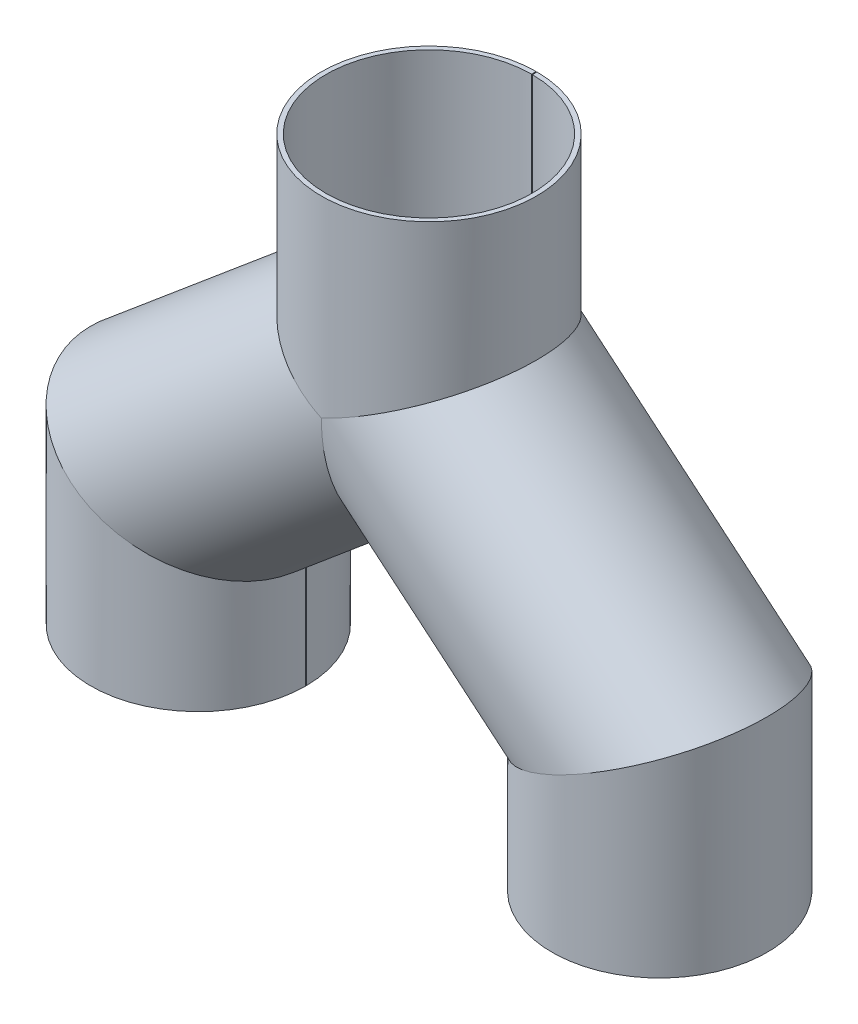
ISO-10303-21;
HEADER;
FILE_DESCRIPTION(('STEP AP214'),'2;1');
FILE_NAME('part.step','',(''),(''),'','','');
FILE_SCHEMA(('AUTOMOTIVE_DESIGN { 1 0 10303 214 1 1 1 1 }'));
ENDSEC;
DATA;
#1=APPLICATION_CONTEXT('core data for automotive mechanical design processes');
#2=APPLICATION_PROTOCOL_DEFINITION('international standard','automotive_design',2000,#1);
#3=PRODUCT_CONTEXT('',#1,'mechanical');
#4=PRODUCT('Part','Part','',(#3));
#5=PRODUCT_RELATED_PRODUCT_CATEGORY('part','',(#4));
#6=PRODUCT_DEFINITION_FORMATION('','',#4);
#7=PRODUCT_DEFINITION_CONTEXT('part definition',#1,'design');
#8=PRODUCT_DEFINITION('design','',#6,#7);
#9=PRODUCT_DEFINITION_SHAPE('','',#8);
#10=(LENGTH_UNIT() NAMED_UNIT(*) SI_UNIT(.MILLI.,.METRE.));
#11=(NAMED_UNIT(*) PLANE_ANGLE_UNIT() SI_UNIT($,.RADIAN.));
#12=(NAMED_UNIT(*) SI_UNIT($,.STERADIAN.) SOLID_ANGLE_UNIT());
#13=UNCERTAINTY_MEASURE_WITH_UNIT(LENGTH_MEASURE(1.E-05),#10,'distance_accuracy_value','');
#14=(GEOMETRIC_REPRESENTATION_CONTEXT(3) GLOBAL_UNCERTAINTY_ASSIGNED_CONTEXT((#13)) GLOBAL_UNIT_ASSIGNED_CONTEXT((#10,
#11,#12)) REPRESENTATION_CONTEXT('',''));
#15=CARTESIAN_POINT('',(0.,0.,0.));
#16=DIRECTION('',(0.,0.,1.));
#17=DIRECTION('',(1.,0.,0.));
#18=AXIS2_PLACEMENT_3D('',#15,#16,#17);
#19=CARTESIAN_POINT('',(-300.,-186.446817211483,0.));
#20=DIRECTION('',(0.,-1.,0.));
#21=DIRECTION('',(0.,0.,-1.));
#22=AXIS2_PLACEMENT_3D('',#19,#20,#21);
#23=CYLINDRICAL_SURFACE('',#22,140.);
#24=DIRECTION('',(0.,-1.,0.));
#25=VECTOR('',#24,1.);
#26=CARTESIAN_POINT('',(-160.00089285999,-186.446817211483,-0.5));
#27=LINE('',#26,#25);
#28=CARTESIAN_POINT('',(-160.00089285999,-317.012545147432,-0.499999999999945));
#29=VERTEX_POINT('',#28);
#30=CARTESIAN_POINT('',(-160.00089285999,-451.729889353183,-0.5));
#31=VERTEX_POINT('',#30);
#32=EDGE_CURVE('E125',#29,#31,#27,.T.);
#33=ORIENTED_EDGE('',*,*,#32,.T.);
#34=CARTESIAN_POINT('',(-300.,-451.729889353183,0.));
#35=DIRECTION('',(0.,-1.,0.));
#36=DIRECTION('',(0.,0.,1.));
#37=AXIS2_PLACEMENT_3D('',#34,#35,#36);
#38=CIRCLE('',#37,140.);
#39=CARTESIAN_POINT('',(-160.00089285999,-451.729889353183,0.5));
#40=VERTEX_POINT('',#39);
#41=EDGE_CURVE('E113',#40,#31,#38,.T.);
#42=ORIENTED_EDGE('',*,*,#41,.F.);
#43=DIRECTION('',(0.,-1.,0.));
#44=VECTOR('',#43,1.);
#45=CARTESIAN_POINT('',(-160.00089285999,-186.446817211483,0.5));
#46=LINE('',#45,#44);
#47=CARTESIAN_POINT('',(-160.00089285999,-317.012545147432,0.499999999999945));
#48=VERTEX_POINT('',#47);
#49=EDGE_CURVE('E103',#48,#40,#46,.T.);
#50=ORIENTED_EDGE('',*,*,#49,.F.);
#51=CARTESIAN_POINT('',(-300.,-251.729889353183,0.));
#52=DIRECTION('',(-0.4226182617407,-0.906307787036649,0.));
#53=DIRECTION('',(0.90630778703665,-0.422618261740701,0.));
#54=AXIS2_PLACEMENT_3D('',#51,#52,#53);
#55=ELLIPSE('',#54,154.472908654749,140.);
#56=EDGE_CURVE('E114',#48,#29,#55,.T.);
#57=ORIENTED_EDGE('',*,*,#56,.T.);
#58=EDGE_LOOP('',(#33,#42,#50,#57));
#59=FACE_BOUND('',#58,.T.);
#60=ADVANCED_FACE('F60',(#59),#23,.T.);
#61=CARTESIAN_POINT('',(-300.,-186.446817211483,0.));
#62=DIRECTION('',(0.,-1.,0.));
#63=DIRECTION('',(0.,0.,-1.));
#64=AXIS2_PLACEMENT_3D('',#61,#62,#63);
#65=CYLINDRICAL_SURFACE('',#64,134.);
#66=CARTESIAN_POINT('',(-300.,-251.729889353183,0.));
#67=DIRECTION('',(-0.4226182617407,-0.906307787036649,0.));
#68=DIRECTION('',(0.90630778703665,-0.422618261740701,0.));
#69=AXIS2_PLACEMENT_3D('',#66,#67,#68);
#70=ELLIPSE('',#69,147.852641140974,134.);
#71=CARTESIAN_POINT('',(-166.000932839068,-314.214680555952,0.499999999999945));
#72=VERTEX_POINT('',#71);
#73=CARTESIAN_POINT('',(-166.000932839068,-314.214680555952,-0.499999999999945));
#74=VERTEX_POINT('',#73);
#75=EDGE_CURVE('E118',#72,#74,#70,.T.);
#76=ORIENTED_EDGE('',*,*,#75,.F.);
#77=DIRECTION('',(0.,-1.,0.));
#78=VECTOR('',#77,1.);
#79=CARTESIAN_POINT('',(-166.000932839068,-186.446817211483,0.5));
#80=LINE('',#79,#78);
#81=CARTESIAN_POINT('',(-166.000932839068,-451.729889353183,0.5));
#82=VERTEX_POINT('',#81);
#83=EDGE_CURVE('E100',#72,#82,#80,.T.);
#84=ORIENTED_EDGE('',*,*,#83,.T.);
#85=CARTESIAN_POINT('',(-300.,-451.729889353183,0.));
#86=DIRECTION('',(0.,-1.,0.));
#87=DIRECTION('',(1.,0.,0.));
#88=AXIS2_PLACEMENT_3D('',#85,#86,#87);
#89=CIRCLE('',#88,134.);
#90=CARTESIAN_POINT('',(-166.000932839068,-451.729889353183,-0.5));
#91=VERTEX_POINT('',#90);
#92=EDGE_CURVE('E110',#82,#91,#89,.T.);
#93=ORIENTED_EDGE('',*,*,#92,.T.);
#94=DIRECTION('',(0.,-1.,0.));
#95=VECTOR('',#94,1.);
#96=CARTESIAN_POINT('',(-166.000932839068,-186.446817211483,-0.5));
#97=LINE('',#96,#95);
#98=EDGE_CURVE('E120',#74,#91,#97,.T.);
#99=ORIENTED_EDGE('',*,*,#98,.F.);
#100=EDGE_LOOP('',(#76,#84,#93,#99));
#101=FACE_BOUND('',#100,.T.);
#102=ADVANCED_FACE('F116',(#101),#65,.F.);
#103=CARTESIAN_POINT('',(-300.,-451.729889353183,0.));
#104=DIRECTION('',(0.,1.,0.));
#105=DIRECTION('',(0.,0.,1.));
#106=AXIS2_PLACEMENT_3D('',#103,#104,#105);
#107=PLANE('',#106);
#108=DIRECTION('',(1.,0.,0.));
#109=VECTOR('',#108,1.);
#110=CARTESIAN_POINT('',(-300.,-451.729889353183,-0.5));
#111=LINE('',#110,#109);
#112=EDGE_CURVE('E107',#91,#31,#111,.T.);
#113=ORIENTED_EDGE('',*,*,#112,.F.);
#114=ORIENTED_EDGE('',*,*,#92,.F.);
#115=DIRECTION('',(1.,0.,0.));
#116=VECTOR('',#115,1.);
#117=CARTESIAN_POINT('',(-300.,-451.729889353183,0.5));
#118=LINE('',#117,#116);
#119=EDGE_CURVE('E96',#82,#40,#118,.T.);
#120=ORIENTED_EDGE('',*,*,#119,.T.);
#121=ORIENTED_EDGE('',*,*,#41,.T.);
#122=EDGE_LOOP('',(#113,#114,#120,#121));
#123=FACE_BOUND('',#122,.T.);
#124=ADVANCED_FACE('F111',(#123),#107,.F.);
#125=CARTESIAN_POINT('',(-160.,-317.012961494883,1365.60438801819));
#126=DIRECTION('',(0.4226182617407,0.906307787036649,0.));
#127=DIRECTION('',(0.90630778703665,-0.422618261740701,0.));
#128=AXIS2_PLACEMENT_3D('',#125,#126,#127);
#129=PLANE('',#128);
#130=ORIENTED_EDGE('',*,*,#56,.F.);
#131=DIRECTION('',(-0.90630778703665,0.422618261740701,0.));
#132=VECTOR('',#131,1.);
#133=CARTESIAN_POINT('',(-160.,-317.012961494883,0.499999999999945));
#134=LINE('',#133,#132);
#135=EDGE_CURVE('E67',#48,#72,#134,.T.);
#136=ORIENTED_EDGE('',*,*,#135,.T.);
#137=ORIENTED_EDGE('',*,*,#75,.T.);
#138=DIRECTION('',(-0.90630778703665,0.422618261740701,0.));
#139=VECTOR('',#138,1.);
#140=CARTESIAN_POINT('',(-160.,-317.012961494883,-0.499999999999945));
#141=LINE('',#140,#139);
#142=EDGE_CURVE('E13',#29,#74,#141,.T.);
#143=ORIENTED_EDGE('',*,*,#142,.F.);
#144=EDGE_LOOP('',(#130,#136,#137,#143));
#145=FACE_BOUND('',#144,.T.);
#146=ADVANCED_FACE('F132',(#145),#129,.T.);
#147=CARTESIAN_POINT('',(-300.,250.,0.5));
#148=DIRECTION('',(0.,0.,1.));
#149=DIRECTION('',(-1.,0.,0.));
#150=AXIS2_PLACEMENT_3D('',#147,#148,#149);
#151=PLANE('',#150);
#152=ORIENTED_EDGE('',*,*,#135,.F.);
#153=ORIENTED_EDGE('',*,*,#49,.T.);
#154=ORIENTED_EDGE('',*,*,#119,.F.);
#155=ORIENTED_EDGE('',*,*,#83,.F.);
#156=EDGE_LOOP('',(#152,#153,#154,#155));
#157=FACE_BOUND('',#156,.T.);
#158=ADVANCED_FACE('F98',(#157),#151,.F.);
#159=CARTESIAN_POINT('',(-300.,250.,-0.5));
#160=DIRECTION('',(0.,0.,1.));
#161=DIRECTION('',(-1.,0.,0.));
#162=AXIS2_PLACEMENT_3D('',#159,#160,#161);
#163=PLANE('',#162);
#164=ORIENTED_EDGE('',*,*,#32,.F.);
#165=ORIENTED_EDGE('',*,*,#142,.T.);
#166=ORIENTED_EDGE('',*,*,#98,.T.);
#167=ORIENTED_EDGE('',*,*,#112,.T.);
#168=EDGE_LOOP('',(#164,#165,#166,#167));
#169=FACE_BOUND('',#168,.T.);
#170=ADVANCED_FACE('F134',(#169),#163,.T.);
#171=CLOSED_SHELL('',(#60,#102,#124,#146,#158,#170));
#172=MANIFOLD_SOLID_BREP('B2',#171);
#173=CARTESIAN_POINT('',(0.,0.,0.));
#174=DIRECTION('',(-0.766044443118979,-0.642787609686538,0.));
#175=DIRECTION('',(-0.642787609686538,0.766044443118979,0.));
#176=AXIS2_PLACEMENT_3D('',#173,#174,#175);
#177=CYLINDRICAL_SURFACE('',#176,140.);
#178=DIRECTION('',(-0.766044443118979,-0.642787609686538,0.));
#179=VECTOR('',#178,1.);
#180=CARTESIAN_POINT('',(89.9896914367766,-107.245538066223,0.5));
#181=LINE('',#180,#179);
#182=CARTESIAN_POINT('',(-160.00089285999,-317.012545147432,0.5));
#183=VERTEX_POINT('',#182);
#184=CARTESIAN_POINT('',(0.,-182.755854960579,0.499999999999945));
#185=VERTEX_POINT('',#184);
#186=EDGE_CURVE('E290',#183,#185,#181,.F.);
#187=ORIENTED_EDGE('',*,*,#186,.T.);
#188=CARTESIAN_POINT('',(0.,0.,0.));
#189=DIRECTION('',(-1.,0.,0.));
#190=DIRECTION('',(0.,-1.,0.));
#191=AXIS2_PLACEMENT_3D('',#188,#189,#190);
#192=ELLIPSE('',#191,182.757020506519,140.);
#193=CARTESIAN_POINT('',(0.,0.,140.));
#194=VERTEX_POINT('',#193);
#195=EDGE_CURVE('E268',#194,#185,#192,.F.);
#196=ORIENTED_EDGE('',*,*,#195,.F.);
#197=CARTESIAN_POINT('',(0.,0.,0.));
#198=DIRECTION('',(0.4226182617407,0.90630778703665,0.));
#199=DIRECTION('',(-0.90630778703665,0.4226182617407,0.));
#200=AXIS2_PLACEMENT_3D('',#197,#198,#199);
#201=ELLIPSE('',#200,154.472908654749,140.);
#202=CARTESIAN_POINT('',(0.,1.11022302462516E-13,-140.));
#203=VERTEX_POINT('',#202);
#204=EDGE_CURVE('E267',#194,#203,#201,.F.);
#205=ORIENTED_EDGE('',*,*,#204,.T.);
#206=CARTESIAN_POINT('',(0.,-182.755854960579,-0.499999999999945));
#207=VERTEX_POINT('',#206);
#208=EDGE_CURVE('E251',#207,#203,#192,.F.);
#209=ORIENTED_EDGE('',*,*,#208,.F.);
#210=DIRECTION('',(-0.766044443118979,-0.642787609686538,0.));
#211=VECTOR('',#210,1.);
#212=CARTESIAN_POINT('',(89.9896914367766,-107.245538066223,-0.5));
#213=LINE('',#212,#211);
#214=CARTESIAN_POINT('',(-160.00089285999,-317.012545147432,-0.5));
#215=VERTEX_POINT('',#214);
#216=EDGE_CURVE('E257',#215,#207,#213,.F.);
#217=ORIENTED_EDGE('',*,*,#216,.F.);
#218=CARTESIAN_POINT('',(-300.,-251.729889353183,0.));
#219=DIRECTION('',(-0.422618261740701,-0.906307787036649,0.));
#220=DIRECTION('',(-0.90630778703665,0.422618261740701,0.));
#221=AXIS2_PLACEMENT_3D('',#218,#219,#220);
#222=ELLIPSE('',#221,154.472908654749,140.);
#223=EDGE_CURVE('E280',#215,#183,#222,.F.);
#224=ORIENTED_EDGE('',*,*,#223,.T.);
#225=EDGE_LOOP('',(#187,#196,#205,#209,#217,#224));
#226=FACE_BOUND('',#225,.T.);
#227=ADVANCED_FACE('F194',(#226),#177,.T.);
#228=CARTESIAN_POINT('',(0.,-451.729889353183,1247.60175690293));
#229=DIRECTION('',(1.,0.,0.));
#230=DIRECTION('',(0.,-1.,0.));
#231=AXIS2_PLACEMENT_3D('',#228,#229,#230);
#232=PLANE('',#231);
#233=ORIENTED_EDGE('',*,*,#208,.T.);
#234=DIRECTION('',(0.,0.,-1.));
#235=VECTOR('',#234,1.);
#236=CARTESIAN_POINT('',(0.,0.,0.));
#237=LINE('',#236,#235);
#238=CARTESIAN_POINT('',(0.,0.,-134.));
#239=VERTEX_POINT('',#238);
#240=EDGE_CURVE('E271',#239,#203,#237,.T.);
#241=ORIENTED_EDGE('',*,*,#240,.F.);
#242=CARTESIAN_POINT('',(0.,0.,0.));
#243=DIRECTION('',(-1.,0.,0.));
#244=DIRECTION('',(0.,-1.,0.));
#245=AXIS2_PLACEMENT_3D('',#242,#243,#244);
#246=ELLIPSE('',#245,174.924576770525,134.);
#247=CARTESIAN_POINT('',(0.,-174.923359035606,-0.499999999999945));
#248=VERTEX_POINT('',#247);
#249=EDGE_CURVE('E253',#248,#239,#246,.F.);
#250=ORIENTED_EDGE('',*,*,#249,.F.);
#251=DIRECTION('',(0.,1.,0.));
#252=VECTOR('',#251,1.);
#253=CARTESIAN_POINT('',(0.,-451.729889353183,-0.499999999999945));
#254=LINE('',#253,#252);
#255=EDGE_CURVE('E201',#207,#248,#254,.T.);
#256=ORIENTED_EDGE('',*,*,#255,.F.);
#257=EDGE_LOOP('',(#233,#241,#250,#256));
#258=FACE_BOUND('',#257,.T.);
#259=ADVANCED_FACE('F248',(#258),#232,.T.);
#260=CARTESIAN_POINT('',(0.,0.,0.));
#261=DIRECTION('',(-0.766044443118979,-0.642787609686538,0.));
#262=DIRECTION('',(-0.642787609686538,0.766044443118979,0.));
#263=AXIS2_PLACEMENT_3D('',#260,#261,#262);
#264=CYLINDRICAL_SURFACE('',#263,134.);
#265=CARTESIAN_POINT('',(-300.,-251.729889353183,0.));
#266=DIRECTION('',(-0.422618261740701,-0.906307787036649,0.));
#267=DIRECTION('',(-0.90630778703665,0.422618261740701,0.));
#268=AXIS2_PLACEMENT_3D('',#265,#266,#267);
#269=ELLIPSE('',#268,147.852641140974,134.);
#270=CARTESIAN_POINT('',(-166.000932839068,-314.214680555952,-0.5));
#271=VERTEX_POINT('',#270);
#272=CARTESIAN_POINT('',(-166.000932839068,-314.214680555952,0.5));
#273=VERTEX_POINT('',#272);
#274=EDGE_CURVE('E279',#271,#273,#269,.F.);
#275=ORIENTED_EDGE('',*,*,#274,.F.);
#276=DIRECTION('',(-0.766044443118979,-0.642787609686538,0.));
#277=VECTOR('',#276,1.);
#278=CARTESIAN_POINT('',(86.1329400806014,-102.649240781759,-0.5));
#279=LINE('',#278,#277);
#280=EDGE_CURVE('E208',#271,#248,#279,.F.);
#281=ORIENTED_EDGE('',*,*,#280,.T.);
#282=ORIENTED_EDGE('',*,*,#249,.T.);
#283=CARTESIAN_POINT('',(0.,0.,0.));
#284=DIRECTION('',(0.4226182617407,0.90630778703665,0.));
#285=DIRECTION('',(-0.90630778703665,0.4226182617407,0.));
#286=AXIS2_PLACEMENT_3D('',#283,#284,#285);
#287=ELLIPSE('',#286,147.852641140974,134.);
#288=CARTESIAN_POINT('',(0.,0.,134.));
#289=VERTEX_POINT('',#288);
#290=EDGE_CURVE('E255',#289,#239,#287,.F.);
#291=ORIENTED_EDGE('',*,*,#290,.F.);
#292=CARTESIAN_POINT('',(0.,-174.923359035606,0.499999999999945));
#293=VERTEX_POINT('',#292);
#294=EDGE_CURVE('E269',#289,#293,#246,.F.);
#295=ORIENTED_EDGE('',*,*,#294,.T.);
#296=DIRECTION('',(-0.766044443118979,-0.642787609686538,0.));
#297=VECTOR('',#296,1.);
#298=CARTESIAN_POINT('',(86.1329400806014,-102.649240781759,0.5));
#299=LINE('',#298,#297);
#300=EDGE_CURVE('E292',#273,#293,#299,.F.);
#301=ORIENTED_EDGE('',*,*,#300,.F.);
#302=EDGE_LOOP('',(#275,#281,#282,#291,#295,#301));
#303=FACE_BOUND('',#302,.T.);
#304=ADVANCED_FACE('F288',(#303),#264,.F.);
#305=CARTESIAN_POINT('',(-160.,-317.012961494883,1319.63553279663));
#306=DIRECTION('',(0.422618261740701,0.906307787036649,0.));
#307=DIRECTION('',(0.906307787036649,-0.422618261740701,0.));
#308=AXIS2_PLACEMENT_3D('',#305,#306,#307);
#309=PLANE('',#308);
#310=ORIENTED_EDGE('',*,*,#223,.F.);
#311=DIRECTION('',(-0.906307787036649,0.422618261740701,0.));
#312=VECTOR('',#311,1.);
#313=CARTESIAN_POINT('',(-160.,-317.012961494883,-0.499999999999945));
#314=LINE('',#313,#312);
#315=EDGE_CURVE('E259',#215,#271,#314,.T.);
#316=ORIENTED_EDGE('',*,*,#315,.T.);
#317=ORIENTED_EDGE('',*,*,#274,.T.);
#318=DIRECTION('',(-0.906307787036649,0.422618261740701,0.));
#319=VECTOR('',#318,1.);
#320=CARTESIAN_POINT('',(-160.,-317.012961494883,0.499999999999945));
#321=LINE('',#320,#319);
#322=EDGE_CURVE('E289',#183,#273,#321,.T.);
#323=ORIENTED_EDGE('',*,*,#322,.F.);
#324=EDGE_LOOP('',(#310,#316,#317,#323));
#325=FACE_BOUND('',#324,.T.);
#326=ADVANCED_FACE('F298',(#325),#309,.F.);
#327=CARTESIAN_POINT('',(-536.126730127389,250.,1247.60175690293));
#328=DIRECTION('',(-0.4226182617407,-0.90630778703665,0.));
#329=DIRECTION('',(-0.90630778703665,0.4226182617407,0.));
#330=AXIS2_PLACEMENT_3D('',#327,#328,#329);
#331=PLANE('',#330);
#332=EDGE_CURVE('E277',#194,#289,#237,.T.);
#333=ORIENTED_EDGE('',*,*,#332,.T.);
#334=ORIENTED_EDGE('',*,*,#290,.T.);
#335=ORIENTED_EDGE('',*,*,#240,.T.);
#336=ORIENTED_EDGE('',*,*,#204,.F.);
#337=EDGE_LOOP('',(#333,#334,#335,#336));
#338=FACE_BOUND('',#337,.T.);
#339=ADVANCED_FACE('F286',(#338),#331,.F.);
#340=DIRECTION('',(0.,1.,0.));
#341=VECTOR('',#340,1.);
#342=CARTESIAN_POINT('',(0.,-451.729889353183,0.499999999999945));
#343=LINE('',#342,#341);
#344=EDGE_CURVE('E58',#185,#293,#343,.T.);
#345=ORIENTED_EDGE('',*,*,#344,.T.);
#346=ORIENTED_EDGE('',*,*,#294,.F.);
#347=ORIENTED_EDGE('',*,*,#332,.F.);
#348=ORIENTED_EDGE('',*,*,#195,.T.);
#349=EDGE_LOOP('',(#345,#346,#347,#348));
#350=FACE_BOUND('',#349,.T.);
#351=ADVANCED_FACE('F305',(#350),#232,.T.);
#352=CARTESIAN_POINT('',(205.256341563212,172.230520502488,-0.5));
#353=DIRECTION('',(0.,0.,1.));
#354=DIRECTION('',(-1.,0.,0.));
#355=AXIS2_PLACEMENT_3D('',#352,#353,#354);
#356=PLANE('',#355);
#357=ORIENTED_EDGE('',*,*,#315,.F.);
#358=ORIENTED_EDGE('',*,*,#216,.T.);
#359=ORIENTED_EDGE('',*,*,#255,.T.);
#360=ORIENTED_EDGE('',*,*,#280,.F.);
#361=EDGE_LOOP('',(#357,#358,#359,#360));
#362=FACE_BOUND('',#361,.T.);
#363=ADVANCED_FACE('F258',(#362),#356,.T.);
#364=CARTESIAN_POINT('',(205.256341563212,172.230520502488,0.5));
#365=DIRECTION('',(0.,0.,1.));
#366=DIRECTION('',(-1.,0.,0.));
#367=AXIS2_PLACEMENT_3D('',#364,#365,#366);
#368=PLANE('',#367);
#369=ORIENTED_EDGE('',*,*,#186,.F.);
#370=ORIENTED_EDGE('',*,*,#322,.T.);
#371=ORIENTED_EDGE('',*,*,#300,.T.);
#372=ORIENTED_EDGE('',*,*,#344,.F.);
#373=EDGE_LOOP('',(#369,#370,#371,#372));
#374=FACE_BOUND('',#373,.T.);
#375=ADVANCED_FACE('F299',(#374),#368,.F.);
#376=CLOSED_SHELL('',(#227,#259,#304,#326,#339,#351,#363,#375));
#377=MANIFOLD_SOLID_BREP('B7',#376);
#378=CARTESIAN_POINT('',(300.,-186.446817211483,0.));
#379=DIRECTION('',(0.,-1.,0.));
#380=DIRECTION('',(0.,0.,-1.));
#381=AXIS2_PLACEMENT_3D('',#378,#379,#380);
#382=CYLINDRICAL_SURFACE('',#381,140.);
#383=DIRECTION('',(0.,-1.,0.));
#384=VECTOR('',#383,1.);
#385=CARTESIAN_POINT('',(160.00089285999,-186.446817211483,-0.5));
#386=LINE('',#385,#384);
#387=CARTESIAN_POINT('',(160.00089285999,-317.012545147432,-0.499999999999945));
#388=VERTEX_POINT('',#387);
#389=CARTESIAN_POINT('',(160.00089285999,-451.729889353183,-0.5));
#390=VERTEX_POINT('',#389);
#391=EDGE_CURVE('E441',#388,#390,#386,.T.);
#392=ORIENTED_EDGE('',*,*,#391,.F.);
#393=CARTESIAN_POINT('',(300.,-251.729889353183,0.));
#394=DIRECTION('',(-0.4226182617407,0.906307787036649,0.));
#395=DIRECTION('',(-0.90630778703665,-0.422618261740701,0.));
#396=AXIS2_PLACEMENT_3D('',#393,#394,#395);
#397=ELLIPSE('',#396,154.472908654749,140.);
#398=CARTESIAN_POINT('',(160.00089285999,-317.012545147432,0.499999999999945));
#399=VERTEX_POINT('',#398);
#400=EDGE_CURVE('E433',#399,#388,#397,.T.);
#401=ORIENTED_EDGE('',*,*,#400,.F.);
#402=DIRECTION('',(0.,-1.,0.));
#403=VECTOR('',#402,1.);
#404=CARTESIAN_POINT('',(160.00089285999,-186.446817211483,0.5));
#405=LINE('',#404,#403);
#406=CARTESIAN_POINT('',(160.00089285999,-451.729889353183,0.5));
#407=VERTEX_POINT('',#406);
#408=EDGE_CURVE('E390',#399,#407,#405,.T.);
#409=ORIENTED_EDGE('',*,*,#408,.T.);
#410=CARTESIAN_POINT('',(300.,-451.729889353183,0.));
#411=DIRECTION('',(0.,1.,0.));
#412=DIRECTION('',(0.,0.,1.));
#413=AXIS2_PLACEMENT_3D('',#410,#411,#412);
#414=CIRCLE('',#413,140.);
#415=EDGE_CURVE('E429',#407,#390,#414,.T.);
#416=ORIENTED_EDGE('',*,*,#415,.T.);
#417=EDGE_LOOP('',(#392,#401,#409,#416));
#418=FACE_BOUND('',#417,.T.);
#419=ADVANCED_FACE('F376',(#418),#382,.T.);
#420=CARTESIAN_POINT('',(300.,-186.446817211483,0.));
#421=DIRECTION('',(0.,-1.,0.));
#422=DIRECTION('',(0.,0.,-1.));
#423=AXIS2_PLACEMENT_3D('',#420,#421,#422);
#424=CYLINDRICAL_SURFACE('',#423,134.);
#425=CARTESIAN_POINT('',(300.,-251.729889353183,0.));
#426=DIRECTION('',(-0.4226182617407,0.906307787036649,0.));
#427=DIRECTION('',(-0.90630778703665,-0.422618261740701,0.));
#428=AXIS2_PLACEMENT_3D('',#425,#426,#427);
#429=ELLIPSE('',#428,147.852641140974,134.);
#430=CARTESIAN_POINT('',(166.000932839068,-314.214680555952,0.499999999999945));
#431=VERTEX_POINT('',#430);
#432=CARTESIAN_POINT('',(166.000932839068,-314.214680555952,-0.499999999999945));
#433=VERTEX_POINT('',#432);
#434=EDGE_CURVE('E437',#431,#433,#429,.T.);
#435=ORIENTED_EDGE('',*,*,#434,.T.);
#436=DIRECTION('',(0.,-1.,0.));
#437=VECTOR('',#436,1.);
#438=CARTESIAN_POINT('',(166.000932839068,-186.446817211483,-0.5));
#439=LINE('',#438,#437);
#440=CARTESIAN_POINT('',(166.000932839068,-451.729889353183,-0.5));
#441=VERTEX_POINT('',#440);
#442=EDGE_CURVE('E398',#433,#441,#439,.T.);
#443=ORIENTED_EDGE('',*,*,#442,.T.);
#444=CARTESIAN_POINT('',(300.,-451.729889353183,0.));
#445=DIRECTION('',(0.,1.,0.));
#446=DIRECTION('',(-1.,0.,0.));
#447=AXIS2_PLACEMENT_3D('',#444,#445,#446);
#448=CIRCLE('',#447,134.);
#449=CARTESIAN_POINT('',(166.000932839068,-451.729889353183,0.5));
#450=VERTEX_POINT('',#449);
#451=EDGE_CURVE('E427',#450,#441,#448,.T.);
#452=ORIENTED_EDGE('',*,*,#451,.F.);
#453=DIRECTION('',(0.,-1.,0.));
#454=VECTOR('',#453,1.);
#455=CARTESIAN_POINT('',(166.000932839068,-186.446817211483,0.5));
#456=LINE('',#455,#454);
#457=EDGE_CURVE('E413',#431,#450,#456,.T.);
#458=ORIENTED_EDGE('',*,*,#457,.F.);
#459=EDGE_LOOP('',(#435,#443,#452,#458));
#460=FACE_BOUND('',#459,.T.);
#461=ADVANCED_FACE('F432',(#460),#424,.F.);
#462=CARTESIAN_POINT('',(300.,-451.729889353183,0.));
#463=DIRECTION('',(0.,1.,0.));
#464=DIRECTION('',(0.,0.,1.));
#465=AXIS2_PLACEMENT_3D('',#462,#463,#464);
#466=PLANE('',#465);
#467=DIRECTION('',(-1.,0.,0.));
#468=VECTOR('',#467,1.);
#469=CARTESIAN_POINT('',(300.,-451.729889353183,-0.5));
#470=LINE('',#469,#468);
#471=EDGE_CURVE('E430',#441,#390,#470,.T.);
#472=ORIENTED_EDGE('',*,*,#471,.T.);
#473=ORIENTED_EDGE('',*,*,#415,.F.);
#474=DIRECTION('',(-1.,0.,0.));
#475=VECTOR('',#474,1.);
#476=CARTESIAN_POINT('',(300.,-451.729889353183,0.5));
#477=LINE('',#476,#475);
#478=EDGE_CURVE('E416',#450,#407,#477,.T.);
#479=ORIENTED_EDGE('',*,*,#478,.F.);
#480=ORIENTED_EDGE('',*,*,#451,.T.);
#481=EDGE_LOOP('',(#472,#473,#479,#480));
#482=FACE_BOUND('',#481,.T.);
#483=ADVANCED_FACE('F426',(#482),#466,.F.);
#484=CARTESIAN_POINT('',(160.,-317.012961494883,1365.60438801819));
#485=DIRECTION('',(-0.4226182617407,0.906307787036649,0.));
#486=DIRECTION('',(-0.90630778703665,-0.422618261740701,0.));
#487=AXIS2_PLACEMENT_3D('',#484,#485,#486);
#488=PLANE('',#487);
#489=ORIENTED_EDGE('',*,*,#400,.T.);
#490=DIRECTION('',(0.90630778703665,0.422618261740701,0.));
#491=VECTOR('',#490,1.);
#492=CARTESIAN_POINT('',(160.,-317.012961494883,-0.499999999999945));
#493=LINE('',#492,#491);
#494=EDGE_CURVE('E192',#388,#433,#493,.T.);
#495=ORIENTED_EDGE('',*,*,#494,.T.);
#496=ORIENTED_EDGE('',*,*,#434,.F.);
#497=DIRECTION('',(0.90630778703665,0.422618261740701,0.));
#498=VECTOR('',#497,1.);
#499=CARTESIAN_POINT('',(160.,-317.012961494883,0.499999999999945));
#500=LINE('',#499,#498);
#501=EDGE_CURVE('E383',#399,#431,#500,.T.);
#502=ORIENTED_EDGE('',*,*,#501,.F.);
#503=EDGE_LOOP('',(#489,#495,#496,#502));
#504=FACE_BOUND('',#503,.T.);
#505=ADVANCED_FACE('F449',(#504),#488,.T.);
#506=CARTESIAN_POINT('',(300.,250.,0.5));
#507=DIRECTION('',(0.,0.,1.));
#508=DIRECTION('',(1.,0.,0.));
#509=AXIS2_PLACEMENT_3D('',#506,#507,#508);
#510=PLANE('',#509);
#511=ORIENTED_EDGE('',*,*,#501,.T.);
#512=ORIENTED_EDGE('',*,*,#457,.T.);
#513=ORIENTED_EDGE('',*,*,#478,.T.);
#514=ORIENTED_EDGE('',*,*,#408,.F.);
#515=EDGE_LOOP('',(#511,#512,#513,#514));
#516=FACE_BOUND('',#515,.T.);
#517=ADVANCED_FACE('F415',(#516),#510,.F.);
#518=CARTESIAN_POINT('',(300.,250.,-0.5));
#519=DIRECTION('',(0.,0.,1.));
#520=DIRECTION('',(1.,0.,0.));
#521=AXIS2_PLACEMENT_3D('',#518,#519,#520);
#522=PLANE('',#521);
#523=ORIENTED_EDGE('',*,*,#391,.T.);
#524=ORIENTED_EDGE('',*,*,#471,.F.);
#525=ORIENTED_EDGE('',*,*,#442,.F.);
#526=ORIENTED_EDGE('',*,*,#494,.F.);
#527=EDGE_LOOP('',(#523,#524,#525,#526));
#528=FACE_BOUND('',#527,.T.);
#529=ADVANCED_FACE('F450',(#528),#522,.T.);
#530=CLOSED_SHELL('',(#419,#461,#483,#505,#517,#529));
#531=MANIFOLD_SOLID_BREP('B52',#530);
#532=CARTESIAN_POINT('',(0.,0.,0.));
#533=DIRECTION('',(0.766044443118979,-0.642787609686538,0.));
#534=DIRECTION('',(0.642787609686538,0.766044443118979,0.));
#535=AXIS2_PLACEMENT_3D('',#532,#533,#534);
#536=CYLINDRICAL_SURFACE('',#535,140.);
#537=DIRECTION('',(0.766044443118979,-0.642787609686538,0.));
#538=VECTOR('',#537,1.);
#539=CARTESIAN_POINT('',(-89.9896914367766,-107.245538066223,0.5));
#540=LINE('',#539,#538);
#541=CARTESIAN_POINT('',(160.00089285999,-317.012545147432,0.5));
#542=VERTEX_POINT('',#541);
#543=CARTESIAN_POINT('',(0.,-182.755854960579,0.499999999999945));
#544=VERTEX_POINT('',#543);
#545=EDGE_CURVE('E530',#542,#544,#540,.F.);
#546=ORIENTED_EDGE('',*,*,#545,.F.);
#547=CARTESIAN_POINT('',(300.,-251.729889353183,0.));
#548=DIRECTION('',(-0.422618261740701,0.906307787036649,0.));
#549=DIRECTION('',(0.90630778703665,0.422618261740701,0.));
#550=AXIS2_PLACEMENT_3D('',#547,#548,#549);
#551=ELLIPSE('',#550,154.472908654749,140.);
#552=CARTESIAN_POINT('',(160.00089285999,-317.012545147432,-0.5));
#553=VERTEX_POINT('',#552);
#554=EDGE_CURVE('E571',#553,#542,#551,.F.);
#555=ORIENTED_EDGE('',*,*,#554,.F.);
#556=DIRECTION('',(0.766044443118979,-0.642787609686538,0.));
#557=VECTOR('',#556,1.);
#558=CARTESIAN_POINT('',(-89.9896914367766,-107.245538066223,-0.5));
#559=LINE('',#558,#557);
#560=CARTESIAN_POINT('',(0.,-182.755854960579,-0.499999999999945));
#561=VERTEX_POINT('',#560);
#562=EDGE_CURVE('E559',#553,#561,#559,.F.);
#563=ORIENTED_EDGE('',*,*,#562,.T.);
#564=CARTESIAN_POINT('',(0.,0.,0.));
#565=DIRECTION('',(-1.,0.,0.));
#566=DIRECTION('',(0.,-1.,0.));
#567=AXIS2_PLACEMENT_3D('',#564,#565,#566);
#568=ELLIPSE('',#567,182.757020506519,140.);
#569=CARTESIAN_POINT('',(0.,1.11022302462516E-13,-140.));
#570=VERTEX_POINT('',#569);
#571=EDGE_CURVE('E568',#561,#570,#568,.F.);
#572=ORIENTED_EDGE('',*,*,#571,.T.);
#573=CARTESIAN_POINT('',(0.,0.,0.));
#574=DIRECTION('',(0.4226182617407,-0.90630778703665,0.));
#575=DIRECTION('',(0.90630778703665,0.4226182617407,0.));
#576=AXIS2_PLACEMENT_3D('',#573,#574,#575);
#577=ELLIPSE('',#576,154.472908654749,140.);
#578=CARTESIAN_POINT('',(0.,0.,140.));
#579=VERTEX_POINT('',#578);
#580=EDGE_CURVE('E589',#579,#570,#577,.F.);
#581=ORIENTED_EDGE('',*,*,#580,.F.);
#582=EDGE_CURVE('E578',#579,#544,#568,.F.);
#583=ORIENTED_EDGE('',*,*,#582,.T.);
#584=EDGE_LOOP('',(#546,#555,#563,#572,#581,#583));
#585=FACE_BOUND('',#584,.T.);
#586=ADVANCED_FACE('F509',(#585),#536,.T.);
#587=CARTESIAN_POINT('',(0.,-451.729889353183,1247.60175690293));
#588=DIRECTION('',(-1.,0.,0.));
#589=DIRECTION('',(0.,-1.,0.));
#590=AXIS2_PLACEMENT_3D('',#587,#588,#589);
#591=PLANE('',#590);
#592=ORIENTED_EDGE('',*,*,#571,.F.);
#593=DIRECTION('',(0.,1.,0.));
#594=VECTOR('',#593,1.);
#595=CARTESIAN_POINT('',(0.,-451.729889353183,-0.499999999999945));
#596=LINE('',#595,#594);
#597=CARTESIAN_POINT('',(0.,-174.923359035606,-0.499999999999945));
#598=VERTEX_POINT('',#597);
#599=EDGE_CURVE('E516',#561,#598,#596,.T.);
#600=ORIENTED_EDGE('',*,*,#599,.T.);
#601=CARTESIAN_POINT('',(0.,0.,0.));
#602=DIRECTION('',(-1.,0.,0.));
#603=DIRECTION('',(0.,-1.,0.));
#604=AXIS2_PLACEMENT_3D('',#601,#602,#603);
#605=ELLIPSE('',#604,174.924576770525,134.);
#606=CARTESIAN_POINT('',(0.,0.,-134.));
#607=VERTEX_POINT('',#606);
#608=EDGE_CURVE('E583',#598,#607,#605,.F.);
#609=ORIENTED_EDGE('',*,*,#608,.T.);
#610=DIRECTION('',(0.,0.,-1.));
#611=VECTOR('',#610,1.);
#612=CARTESIAN_POINT('',(0.,0.,0.));
#613=LINE('',#612,#611);
#614=EDGE_CURVE('E577',#607,#570,#613,.T.);
#615=ORIENTED_EDGE('',*,*,#614,.T.);
#616=EDGE_LOOP('',(#592,#600,#609,#615));
#617=FACE_BOUND('',#616,.T.);
#618=ADVANCED_FACE('F575',(#617),#591,.T.);
#619=CARTESIAN_POINT('',(0.,0.,0.));
#620=DIRECTION('',(0.766044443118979,-0.642787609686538,0.));
#621=DIRECTION('',(0.642787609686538,0.766044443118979,0.));
#622=AXIS2_PLACEMENT_3D('',#619,#620,#621);
#623=CYLINDRICAL_SURFACE('',#622,134.);
#624=CARTESIAN_POINT('',(300.,-251.729889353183,0.));
#625=DIRECTION('',(-0.422618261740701,0.906307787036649,0.));
#626=DIRECTION('',(0.90630778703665,0.422618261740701,0.));
#627=AXIS2_PLACEMENT_3D('',#624,#625,#626);
#628=ELLIPSE('',#627,147.852641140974,134.);
#629=CARTESIAN_POINT('',(166.000932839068,-314.214680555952,-0.5));
#630=VERTEX_POINT('',#629);
#631=CARTESIAN_POINT('',(166.000932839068,-314.214680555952,0.5));
#632=VERTEX_POINT('',#631);
#633=EDGE_CURVE('E591',#630,#632,#628,.F.);
#634=ORIENTED_EDGE('',*,*,#633,.T.);
#635=DIRECTION('',(0.766044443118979,-0.642787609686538,0.));
#636=VECTOR('',#635,1.);
#637=CARTESIAN_POINT('',(-86.1329400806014,-102.649240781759,0.5));
#638=LINE('',#637,#636);
#639=CARTESIAN_POINT('',(0.,-174.923359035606,0.499999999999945));
#640=VERTEX_POINT('',#639);
#641=EDGE_CURVE('E607',#632,#640,#638,.F.);
#642=ORIENTED_EDGE('',*,*,#641,.T.);
#643=CARTESIAN_POINT('',(0.,0.,134.));
#644=VERTEX_POINT('',#643);
#645=EDGE_CURVE('E579',#644,#640,#605,.F.);
#646=ORIENTED_EDGE('',*,*,#645,.F.);
#647=CARTESIAN_POINT('',(0.,0.,0.));
#648=DIRECTION('',(0.4226182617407,-0.90630778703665,0.));
#649=DIRECTION('',(0.90630778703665,0.4226182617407,0.));
#650=AXIS2_PLACEMENT_3D('',#647,#648,#649);
#651=ELLIPSE('',#650,147.852641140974,134.);
#652=EDGE_CURVE('E564',#644,#607,#651,.F.);
#653=ORIENTED_EDGE('',*,*,#652,.T.);
#654=ORIENTED_EDGE('',*,*,#608,.F.);
#655=DIRECTION('',(0.766044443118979,-0.642787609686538,0.));
#656=VECTOR('',#655,1.);
#657=CARTESIAN_POINT('',(-86.1329400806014,-102.649240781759,-0.5));
#658=LINE('',#657,#656);
#659=EDGE_CURVE('E523',#630,#598,#658,.F.);
#660=ORIENTED_EDGE('',*,*,#659,.F.);
#661=EDGE_LOOP('',(#634,#642,#646,#653,#654,#660));
#662=FACE_BOUND('',#661,.T.);
#663=ADVANCED_FACE('F598',(#662),#623,.F.);
#664=CARTESIAN_POINT('',(160.,-317.012961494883,1319.63553279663));
#665=DIRECTION('',(-0.422618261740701,0.906307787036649,0.));
#666=DIRECTION('',(-0.906307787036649,-0.422618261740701,0.));
#667=AXIS2_PLACEMENT_3D('',#664,#665,#666);
#668=PLANE('',#667);
#669=ORIENTED_EDGE('',*,*,#554,.T.);
#670=DIRECTION('',(0.906307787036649,0.422618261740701,0.));
#671=VECTOR('',#670,1.);
#672=CARTESIAN_POINT('',(160.,-317.012961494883,0.499999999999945));
#673=LINE('',#672,#671);
#674=EDGE_CURVE('E606',#542,#632,#673,.T.);
#675=ORIENTED_EDGE('',*,*,#674,.T.);
#676=ORIENTED_EDGE('',*,*,#633,.F.);
#677=DIRECTION('',(0.906307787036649,0.422618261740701,0.));
#678=VECTOR('',#677,1.);
#679=CARTESIAN_POINT('',(160.,-317.012961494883,-0.499999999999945));
#680=LINE('',#679,#678);
#681=EDGE_CURVE('E572',#553,#630,#680,.T.);
#682=ORIENTED_EDGE('',*,*,#681,.F.);
#683=EDGE_LOOP('',(#669,#675,#676,#682));
#684=FACE_BOUND('',#683,.T.);
#685=ADVANCED_FACE('F611',(#684),#668,.F.);
#686=CARTESIAN_POINT('',(536.126730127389,250.,1247.60175690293));
#687=DIRECTION('',(0.4226182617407,-0.90630778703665,0.));
#688=DIRECTION('',(0.90630778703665,0.4226182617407,0.));
#689=AXIS2_PLACEMENT_3D('',#686,#687,#688);
#690=PLANE('',#689);
#691=EDGE_CURVE('E588',#579,#644,#613,.T.);
#692=ORIENTED_EDGE('',*,*,#691,.F.);
#693=ORIENTED_EDGE('',*,*,#580,.T.);
#694=ORIENTED_EDGE('',*,*,#614,.F.);
#695=ORIENTED_EDGE('',*,*,#652,.F.);
#696=EDGE_LOOP('',(#692,#693,#694,#695));
#697=FACE_BOUND('',#696,.T.);
#698=ADVANCED_FACE('F602',(#697),#690,.F.);
#699=DIRECTION('',(0.,1.,0.));
#700=VECTOR('',#699,1.);
#701=CARTESIAN_POINT('',(0.,-451.729889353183,0.499999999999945));
#702=LINE('',#701,#700);
#703=EDGE_CURVE('E374',#544,#640,#702,.T.);
#704=ORIENTED_EDGE('',*,*,#703,.F.);
#705=ORIENTED_EDGE('',*,*,#582,.F.);
#706=ORIENTED_EDGE('',*,*,#691,.T.);
#707=ORIENTED_EDGE('',*,*,#645,.T.);
#708=EDGE_LOOP('',(#704,#705,#706,#707));
#709=FACE_BOUND('',#708,.T.);
#710=ADVANCED_FACE('F605',(#709),#591,.T.);
#711=CARTESIAN_POINT('',(-205.256341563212,172.230520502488,-0.5));
#712=DIRECTION('',(0.,0.,1.));
#713=DIRECTION('',(1.,0.,0.));
#714=AXIS2_PLACEMENT_3D('',#711,#712,#713);
#715=PLANE('',#714);
#716=ORIENTED_EDGE('',*,*,#681,.T.);
#717=ORIENTED_EDGE('',*,*,#659,.T.);
#718=ORIENTED_EDGE('',*,*,#599,.F.);
#719=ORIENTED_EDGE('',*,*,#562,.F.);
#720=EDGE_LOOP('',(#716,#717,#718,#719));
#721=FACE_BOUND('',#720,.T.);
#722=ADVANCED_FACE('F558',(#721),#715,.T.);
#723=CARTESIAN_POINT('',(-205.256341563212,172.230520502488,0.5));
#724=DIRECTION('',(0.,0.,1.));
#725=DIRECTION('',(1.,0.,0.));
#726=AXIS2_PLACEMENT_3D('',#723,#724,#725);
#727=PLANE('',#726);
#728=ORIENTED_EDGE('',*,*,#545,.T.);
#729=ORIENTED_EDGE('',*,*,#703,.T.);
#730=ORIENTED_EDGE('',*,*,#641,.F.);
#731=ORIENTED_EDGE('',*,*,#674,.F.);
#732=EDGE_LOOP('',(#728,#729,#730,#731));
#733=FACE_BOUND('',#732,.T.);
#734=ADVANCED_FACE('F616',(#733),#727,.F.);
#735=CLOSED_SHELL('',(#586,#618,#663,#685,#698,#710,#722,#734));
#736=MANIFOLD_SOLID_BREP('B186',#735);
#737=CARTESIAN_POINT('',(0.,250.,0.));
#738=DIRECTION('',(0.,-1.,0.));
#739=DIRECTION('',(0.,0.,-1.));
#740=AXIS2_PLACEMENT_3D('',#737,#738,#739);
#741=CYLINDRICAL_SURFACE('',#740,140.);
#742=CARTESIAN_POINT('',(0.,0.,0.));
#743=DIRECTION('',(0.4226182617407,-0.90630778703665,0.));
#744=DIRECTION('',(-0.90630778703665,-0.4226182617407,0.));
#745=AXIS2_PLACEMENT_3D('',#742,#743,#744);
#746=ELLIPSE('',#745,154.472908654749,140.);
#747=CARTESIAN_POINT('',(0.499999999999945,0.233153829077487,-139.99910714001));
#748=VERTEX_POINT('',#747);
#749=CARTESIAN_POINT('',(3.57132143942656E-13,0.,140.));
#750=VERTEX_POINT('',#749);
#751=EDGE_CURVE('E740',#748,#750,#746,.T.);
#752=ORIENTED_EDGE('',*,*,#751,.F.);
#753=DIRECTION('',(0.,-1.,0.));
#754=VECTOR('',#753,1.);
#755=CARTESIAN_POINT('',(0.499999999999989,250.,-139.99910714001));
#756=LINE('',#755,#754);
#757=CARTESIAN_POINT('',(0.499999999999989,250.,-139.99910714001));
#758=VERTEX_POINT('',#757);
#759=EDGE_CURVE('E702',#748,#758,#756,.F.);
#760=ORIENTED_EDGE('',*,*,#759,.T.);
#761=CARTESIAN_POINT('',(0.,250.,0.));
#762=DIRECTION('',(0.,1.,0.));
#763=DIRECTION('',(0.,0.,1.));
#764=AXIS2_PLACEMENT_3D('',#761,#762,#763);
#765=CIRCLE('',#764,140.);
#766=CARTESIAN_POINT('',(-0.500000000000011,250.,-139.99910714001));
#767=VERTEX_POINT('',#766);
#768=EDGE_CURVE('E738',#767,#758,#765,.T.);
#769=ORIENTED_EDGE('',*,*,#768,.F.);
#770=DIRECTION('',(0.,-1.,0.));
#771=VECTOR('',#770,1.);
#772=CARTESIAN_POINT('',(-0.500000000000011,250.,-139.99910714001));
#773=LINE('',#772,#771);
#774=CARTESIAN_POINT('',(-0.499999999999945,0.233153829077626,-139.99910714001));
#775=VERTEX_POINT('',#774);
#776=EDGE_CURVE('E763',#775,#767,#773,.F.);
#777=ORIENTED_EDGE('',*,*,#776,.F.);
#778=CARTESIAN_POINT('',(0.,1.66533453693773E-13,0.));
#779=DIRECTION('',(0.422618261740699,0.90630778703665,0.));
#780=DIRECTION('',(0.90630778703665,-0.422618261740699,0.));
#781=AXIS2_PLACEMENT_3D('',#778,#779,#780);
#782=ELLIPSE('',#781,154.472908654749,140.);
#783=EDGE_CURVE('E748',#775,#750,#782,.T.);
#784=ORIENTED_EDGE('',*,*,#783,.T.);
#785=EDGE_LOOP('',(#752,#760,#769,#777,#784));
#786=FACE_BOUND('',#785,.T.);
#787=ADVANCED_FACE('F681',(#786),#741,.T.);
#788=CARTESIAN_POINT('',(-536.12673012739,250.,760.368473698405));
#789=DIRECTION('',(0.422618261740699,0.90630778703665,0.));
#790=DIRECTION('',(-0.90630778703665,0.422618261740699,0.));
#791=AXIS2_PLACEMENT_3D('',#788,#789,#790);
#792=PLANE('',#791);
#793=DIRECTION('',(0.,0.,-1.));
#794=VECTOR('',#793,1.);
#795=CARTESIAN_POINT('',(-0.499999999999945,0.233153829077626,760.368473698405));
#796=LINE('',#795,#794);
#797=CARTESIAN_POINT('',(-0.499999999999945,0.233153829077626,-133.999067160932));
#798=VERTEX_POINT('',#797);
#799=EDGE_CURVE('E507',#798,#775,#796,.T.);
#800=ORIENTED_EDGE('',*,*,#799,.F.);
#801=CARTESIAN_POINT('',(0.,1.66533453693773E-13,0.));
#802=DIRECTION('',(0.422618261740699,0.90630778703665,0.));
#803=DIRECTION('',(0.90630778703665,-0.422618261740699,0.));
#804=AXIS2_PLACEMENT_3D('',#801,#802,#803);
#805=ELLIPSE('',#804,147.852641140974,134.);
#806=CARTESIAN_POINT('',(3.57132143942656E-13,0.,134.));
#807=VERTEX_POINT('',#806);
#808=EDGE_CURVE('E744',#798,#807,#805,.T.);
#809=ORIENTED_EDGE('',*,*,#808,.T.);
#810=DIRECTION('',(0.,0.,-1.));
#811=VECTOR('',#810,1.);
#812=CARTESIAN_POINT('',(3.2837643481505E-13,0.,0.));
#813=LINE('',#812,#811);
#814=EDGE_CURVE('E762',#750,#807,#813,.T.);
#815=ORIENTED_EDGE('',*,*,#814,.F.);
#816=ORIENTED_EDGE('',*,*,#783,.F.);
#817=EDGE_LOOP('',(#800,#809,#815,#816));
#818=FACE_BOUND('',#817,.T.);
#819=ADVANCED_FACE('F771',(#818),#792,.F.);
#820=CARTESIAN_POINT('',(0.,250.,0.));
#821=DIRECTION('',(0.,-1.,0.));
#822=DIRECTION('',(0.,0.,-1.));
#823=AXIS2_PLACEMENT_3D('',#820,#821,#822);
#824=CYLINDRICAL_SURFACE('',#823,134.);
#825=DIRECTION('',(0.,-1.,0.));
#826=VECTOR('',#825,1.);
#827=CARTESIAN_POINT('',(0.499999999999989,250.,-133.999067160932));
#828=LINE('',#827,#826);
#829=CARTESIAN_POINT('',(0.499999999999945,0.233153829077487,-133.999067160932));
#830=VERTEX_POINT('',#829);
#831=CARTESIAN_POINT('',(0.499999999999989,250.,-133.999067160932));
#832=VERTEX_POINT('',#831);
#833=EDGE_CURVE('E727',#830,#832,#828,.F.);
#834=ORIENTED_EDGE('',*,*,#833,.F.);
#835=CARTESIAN_POINT('',(0.,0.,0.));
#836=DIRECTION('',(0.4226182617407,-0.90630778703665,0.));
#837=DIRECTION('',(-0.90630778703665,-0.4226182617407,0.));
#838=AXIS2_PLACEMENT_3D('',#835,#836,#837);
#839=ELLIPSE('',#838,147.852641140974,134.);
#840=EDGE_CURVE('E757',#830,#807,#839,.T.);
#841=ORIENTED_EDGE('',*,*,#840,.T.);
#842=ORIENTED_EDGE('',*,*,#808,.F.);
#843=DIRECTION('',(0.,-1.,0.));
#844=VECTOR('',#843,1.);
#845=CARTESIAN_POINT('',(-0.500000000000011,250.,-133.999067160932));
#846=LINE('',#845,#844);
#847=CARTESIAN_POINT('',(-0.500000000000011,250.,-133.999067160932));
#848=VERTEX_POINT('',#847);
#849=EDGE_CURVE('E694',#798,#848,#846,.F.);
#850=ORIENTED_EDGE('',*,*,#849,.T.);
#851=CARTESIAN_POINT('',(0.,250.,0.));
#852=DIRECTION('',(0.,1.,0.));
#853=DIRECTION('',(1.,0.,0.));
#854=AXIS2_PLACEMENT_3D('',#851,#852,#853);
#855=CIRCLE('',#854,134.);
#856=EDGE_CURVE('E745',#848,#832,#855,.T.);
#857=ORIENTED_EDGE('',*,*,#856,.T.);
#858=EDGE_LOOP('',(#834,#841,#842,#850,#857));
#859=FACE_BOUND('',#858,.T.);
#860=ADVANCED_FACE('F755',(#859),#824,.F.);
#861=CARTESIAN_POINT('',(0.,250.,0.));
#862=DIRECTION('',(0.,1.,0.));
#863=DIRECTION('',(0.,0.,1.));
#864=AXIS2_PLACEMENT_3D('',#861,#862,#863);
#865=PLANE('',#864);
#866=DIRECTION('',(0.,0.,1.));
#867=VECTOR('',#866,1.);
#868=CARTESIAN_POINT('',(0.499999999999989,250.,-140.));
#869=LINE('',#868,#867);
#870=EDGE_CURVE('E724',#758,#832,#869,.T.);
#871=ORIENTED_EDGE('',*,*,#870,.T.);
#872=ORIENTED_EDGE('',*,*,#856,.F.);
#873=DIRECTION('',(0.,0.,1.));
#874=VECTOR('',#873,1.);
#875=CARTESIAN_POINT('',(-0.500000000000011,250.,-140.));
#876=LINE('',#875,#874);
#877=EDGE_CURVE('E732',#767,#848,#876,.T.);
#878=ORIENTED_EDGE('',*,*,#877,.F.);
#879=ORIENTED_EDGE('',*,*,#768,.T.);
#880=EDGE_LOOP('',(#871,#872,#878,#879));
#881=FACE_BOUND('',#880,.T.);
#882=ADVANCED_FACE('F743',(#881),#865,.T.);
#883=CARTESIAN_POINT('',(536.126730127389,250.,760.368473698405));
#884=DIRECTION('',(0.4226182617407,-0.90630778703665,0.));
#885=DIRECTION('',(0.90630778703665,0.4226182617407,0.));
#886=AXIS2_PLACEMENT_3D('',#883,#884,#885);
#887=PLANE('',#886);
#888=DIRECTION('',(0.,0.,1.));
#889=VECTOR('',#888,1.);
#890=CARTESIAN_POINT('',(0.499999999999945,0.233153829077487,760.368473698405));
#891=LINE('',#890,#889);
#892=EDGE_CURVE('E688',#748,#830,#891,.T.);
#893=ORIENTED_EDGE('',*,*,#892,.F.);
#894=ORIENTED_EDGE('',*,*,#751,.T.);
#895=ORIENTED_EDGE('',*,*,#814,.T.);
#896=ORIENTED_EDGE('',*,*,#840,.F.);
#897=EDGE_LOOP('',(#893,#894,#895,#896));
#898=FACE_BOUND('',#897,.T.);
#899=ADVANCED_FACE('F760',(#898),#887,.T.);
#900=CARTESIAN_POINT('',(0.5,-451.729889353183,-140.));
#901=DIRECTION('',(1.,0.,0.));
#902=DIRECTION('',(0.,1.,0.));
#903=AXIS2_PLACEMENT_3D('',#900,#901,#902);
#904=PLANE('',#903);
#905=ORIENTED_EDGE('',*,*,#892,.T.);
#906=ORIENTED_EDGE('',*,*,#833,.T.);
#907=ORIENTED_EDGE('',*,*,#870,.F.);
#908=ORIENTED_EDGE('',*,*,#759,.F.);
#909=EDGE_LOOP('',(#905,#906,#907,#908));
#910=FACE_BOUND('',#909,.T.);
#911=ADVANCED_FACE('F725',(#910),#904,.F.);
#912=CARTESIAN_POINT('',(-0.5,-451.729889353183,-140.));
#913=DIRECTION('',(1.,0.,0.));
#914=DIRECTION('',(0.,1.,0.));
#915=AXIS2_PLACEMENT_3D('',#912,#913,#914);
#916=PLANE('',#915);
#917=ORIENTED_EDGE('',*,*,#776,.T.);
#918=ORIENTED_EDGE('',*,*,#877,.T.);
#919=ORIENTED_EDGE('',*,*,#849,.F.);
#920=ORIENTED_EDGE('',*,*,#799,.T.);
#921=EDGE_LOOP('',(#917,#918,#919,#920));
#922=FACE_BOUND('',#921,.T.);
#923=ADVANCED_FACE('F773',(#922),#916,.T.);
#924=CLOSED_SHELL('',(#787,#819,#860,#882,#899,#911,#923));
#925=MANIFOLD_SOLID_BREP('B368',#924);
#926=ADVANCED_BREP_SHAPE_REPRESENTATION('',(#18,#172,#377,#531,#736,#925),#14);
#927=SHAPE_DEFINITION_REPRESENTATION(#9,#926);
ENDSEC;
END-ISO-10303-21;
